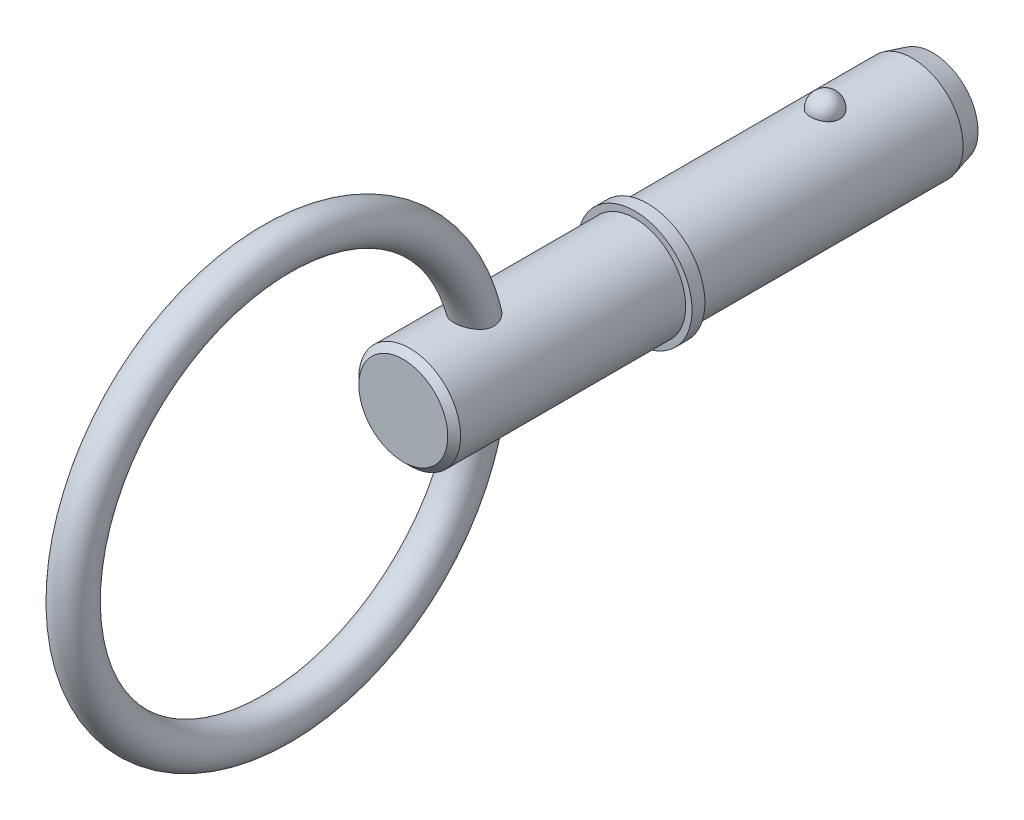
from build123d import *

# Parameters (mm, degrees)
SKETCH2_R           = 3.97
BOSS_EXTRUDE1_DEPTH = 12.7
BOSS_EXTRUDE2_START = 9.53
SKETCH3_R           = 3.97
BOSS_EXTRUDE2_DEPTH = 9.53
CHAMFER1_SIZE       = 1.586
CHAMFER1_SIZE2      = 0.424967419
SKETCH20_W          = 1
SKETCH20_H          = 4.47
SKETCH21_R          = 3.97
BOSS_EXTRUDE3_DEPTH = 19.05
CHAMFER2_SIZE       = 0.5
SKETCH24_R          = 1.5


with BuildPart() as part:
    # Sketch2 → Boss-Extrude1 (new body)
    with BuildSketch(Plane.XY):
        Circle(SKETCH2_R)
    extrude(amount=BOSS_EXTRUDE1_DEPTH)

    # Sketch3 → Boss-Extrude2 (add)
    with BuildSketch(Plane(origin=(0, 0, 0), x_dir=(-1, 0, 0), z_dir=(0, 0, -1)).offset(BOSS_EXTRUDE2_START)):
        Circle(SKETCH3_R)
    extrude(amount=-BOSS_EXTRUDE2_DEPTH)

    # Chamfer1
    chamfer1_edges = [part.edges().sort_by_distance(p)[0] for p in [
        (3.97, 0, -9.53),
    ]]
    chamfer1_side = [part.faces().sort_by_distance(p)[0] for p in [
        (3.97, 0, -4.765),
    ]]
    chamfer(chamfer1_edges, length=CHAMFER1_SIZE, length2=CHAMFER1_SIZE2, reference=chamfer1_side[0])

    # Sketch18 → Revolve1 (revolve)
    with BuildSketch(Plane(origin=(0, 0, 0), x_dir=(0, 0, -1), z_dir=(1, 0, 0))):
        with BuildLine():
            Line((1.15, 5.12), (1.15, 2.82))
            ThreePointArc((1.15, 2.82), (0, 3.97), (1.15, 5.12))
        make_face()
    revolve(axis=Axis((0, 5.12, -1.15), (0, -1, 0)))

    # Sketch20 → Revolve2 (revolve)
    with BuildSketch(Plane(origin=(0, 0, 0), x_dir=(0, 0, -1), z_dir=(1, 0, 0)), mode=Mode.PRIVATE) as revolve2_sk:
        with Locations((-13.2, 2.235)):
            Rectangle(SKETCH20_W, SKETCH20_H)
    revolve(revolve2_sk.sketch.rotate(Axis((0, 0, 33.728787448), (0, 0, 1)), 90), axis=Axis((0, 0, 33.728787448), (0, 0, 1)))

    # Sketch21 → Boss-Extrude3 (add)
    with BuildSketch(Plane(origin=(0, 0, 12.7), x_dir=(-1, 0, 0), z_dir=(0, 0, -1))):
        Circle(SKETCH21_R)
    extrude(amount=-BOSS_EXTRUDE3_DEPTH)

    # Chamfer2
    chamfer2_edges = [part.edges().sort_by_distance(p)[0] for p in [
        (3.97, 0, 31.75),
    ]]
    chamfer(chamfer2_edges, length=CHAMFER2_SIZE)

    # Sweep1: sweep along a path in Sketch23
    with BuildLine(Plane(origin=(0, 0, 0), x_dir=(0, 0, -1), z_dir=(1, 0, 0))) as sweep1_path:
        CenterArc((-41.625, 0), 15.875, 0, 360)
    # Sketch24 → Sweep1 (sweep)
    with BuildSketch(Plane(origin=(0, 0, 0), x_dir=(1, 0, 0), z_dir=(0, 1, 0))):
        with Locations((0, -25.75)):
            Circle(SKETCH24_R)
    sweep(path=sweep1_path.line)


solid = part.part
